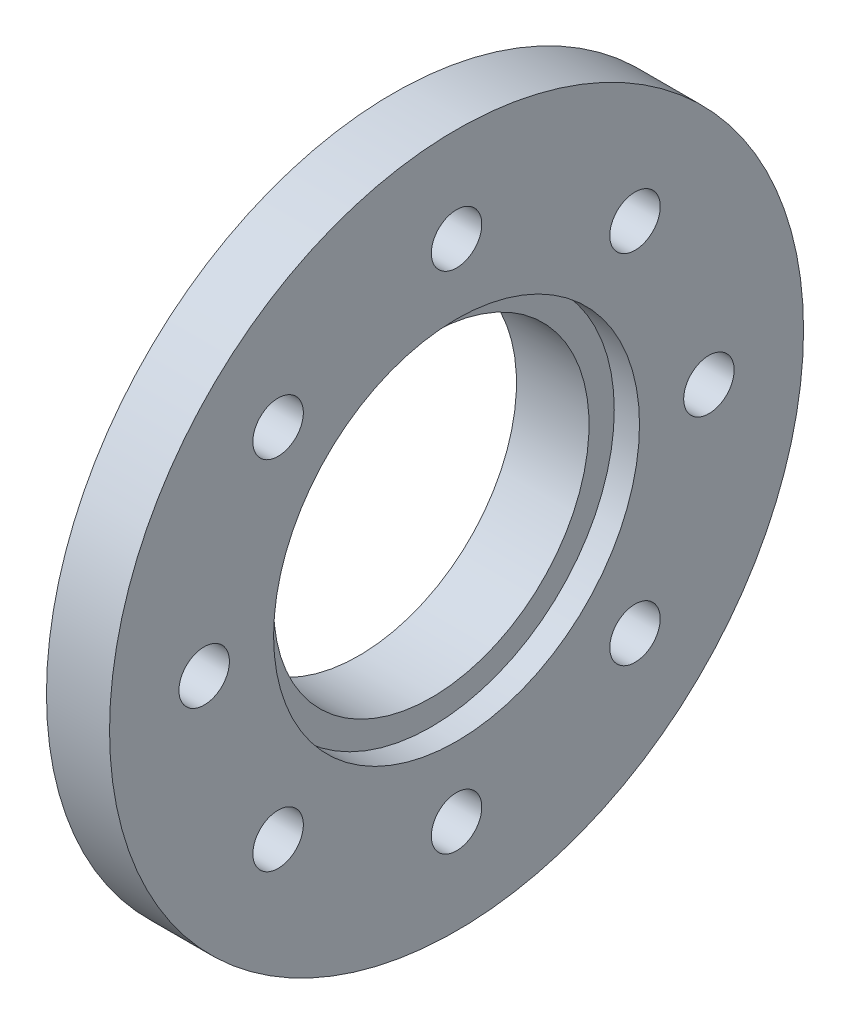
ISO-10303-21;
HEADER;
FILE_DESCRIPTION(('STEP AP214'),'2;1');
FILE_NAME('part.step','',(''),(''),'','','');
FILE_SCHEMA(('AUTOMOTIVE_DESIGN { 1 0 10303 214 1 1 1 1 }'));
ENDSEC;
DATA;
#1=APPLICATION_CONTEXT('core data for automotive mechanical design processes');
#2=APPLICATION_PROTOCOL_DEFINITION('international standard','automotive_design',2000,#1);
#3=PRODUCT_CONTEXT('',#1,'mechanical');
#4=PRODUCT('Part','Part','',(#3));
#5=PRODUCT_RELATED_PRODUCT_CATEGORY('part','',(#4));
#6=PRODUCT_DEFINITION_FORMATION('','',#4);
#7=PRODUCT_DEFINITION_CONTEXT('part definition',#1,'design');
#8=PRODUCT_DEFINITION('design','',#6,#7);
#9=PRODUCT_DEFINITION_SHAPE('','',#8);
#10=(LENGTH_UNIT() NAMED_UNIT(*) SI_UNIT(.MILLI.,.METRE.));
#11=(NAMED_UNIT(*) PLANE_ANGLE_UNIT() SI_UNIT($,.RADIAN.));
#12=(NAMED_UNIT(*) SI_UNIT($,.STERADIAN.) SOLID_ANGLE_UNIT());
#13=UNCERTAINTY_MEASURE_WITH_UNIT(LENGTH_MEASURE(1.E-05),#10,'distance_accuracy_value','');
#14=(GEOMETRIC_REPRESENTATION_CONTEXT(3) GLOBAL_UNCERTAINTY_ASSIGNED_CONTEXT((#13)) GLOBAL_UNIT_ASSIGNED_CONTEXT((#10,
#11,#12)) REPRESENTATION_CONTEXT('',''));
#15=CARTESIAN_POINT('',(0.,0.,0.));
#16=DIRECTION('',(0.,0.,1.));
#17=DIRECTION('',(1.,0.,0.));
#18=AXIS2_PLACEMENT_3D('',#15,#16,#17);
#19=CARTESIAN_POINT('',(0.,5.,0.));
#20=DIRECTION('',(1.,0.,0.));
#21=DIRECTION('',(0.,0.,-1.));
#22=AXIS2_PLACEMENT_3D('',#19,#20,#21);
#23=PLANE('',#22);
#24=CARTESIAN_POINT('',(0.,0.,0.));
#25=DIRECTION('',(-1.,0.,0.));
#26=DIRECTION('',(0.,0.,1.));
#27=AXIS2_PLACEMENT_3D('',#24,#25,#26);
#28=CIRCLE('',#27,6.25);
#29=CARTESIAN_POINT('',(0.,0.,6.25000000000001));
#30=VERTEX_POINT('',#29);
#31=EDGE_CURVE('E17',#30,#30,#28,.F.);
#32=ORIENTED_EDGE('',*,*,#31,.F.);
#33=EDGE_LOOP('',(#32));
#34=FACE_BOUND('',#33,.T.);
#35=CARTESIAN_POINT('',(0.,0.,0.));
#36=DIRECTION('',(-1.,0.,0.));
#37=DIRECTION('',(0.,0.,1.));
#38=AXIS2_PLACEMENT_3D('',#35,#36,#37);
#39=CIRCLE('',#38,5.);
#40=CARTESIAN_POINT('',(0.,0.,5.));
#41=VERTEX_POINT('',#40);
#42=EDGE_CURVE('E87',#41,#41,#39,.F.);
#43=ORIENTED_EDGE('',*,*,#42,.T.);
#44=EDGE_LOOP('',(#43));
#45=FACE_BOUND('',#44,.T.);
#46=ADVANCED_FACE('F13',(#34,#45),#23,.F.);
#47=CARTESIAN_POINT('',(0.,0.,0.));
#48=DIRECTION('',(-1.,0.,0.));
#49=DIRECTION('',(0.,0.,1.));
#50=AXIS2_PLACEMENT_3D('',#47,#48,#49);
#51=CYLINDRICAL_SURFACE('',#50,6.25);
#52=ORIENTED_EDGE('',*,*,#31,.T.);
#53=EDGE_LOOP('',(#52));
#54=FACE_BOUND('',#53,.T.);
#55=CARTESIAN_POINT('',(1.1,0.,0.));
#56=DIRECTION('',(-1.,0.,0.));
#57=DIRECTION('',(0.,0.,1.));
#58=AXIS2_PLACEMENT_3D('',#55,#56,#57);
#59=CIRCLE('',#58,6.25);
#60=CARTESIAN_POINT('',(1.1,0.,6.25000000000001));
#61=VERTEX_POINT('',#60);
#62=EDGE_CURVE('E85',#61,#61,#59,.T.);
#63=ORIENTED_EDGE('',*,*,#62,.T.);
#64=EDGE_LOOP('',(#63));
#65=FACE_BOUND('',#64,.T.);
#66=ADVANCED_FACE('F94',(#54,#65),#51,.T.);
#67=CARTESIAN_POINT('',(0.,0.,0.));
#68=DIRECTION('',(-1.,0.,0.));
#69=DIRECTION('',(0.,0.,1.));
#70=AXIS2_PLACEMENT_3D('',#67,#68,#69);
#71=CYLINDRICAL_SURFACE('',#70,5.);
#72=CARTESIAN_POINT('',(2.3,0.,0.));
#73=DIRECTION('',(-1.,0.,0.));
#74=DIRECTION('',(0.,0.,1.));
#75=AXIS2_PLACEMENT_3D('',#72,#73,#74);
#76=CIRCLE('',#75,5.);
#77=CARTESIAN_POINT('',(2.3,0.,5.));
#78=VERTEX_POINT('',#77);
#79=EDGE_CURVE('E82',#78,#78,#76,.F.);
#80=ORIENTED_EDGE('',*,*,#79,.T.);
#81=EDGE_LOOP('',(#80));
#82=FACE_BOUND('',#81,.T.);
#83=ORIENTED_EDGE('',*,*,#42,.F.);
#84=EDGE_LOOP('',(#83));
#85=FACE_BOUND('',#84,.T.);
#86=ADVANCED_FACE('F102',(#82,#85),#71,.F.);
#87=CARTESIAN_POINT('',(1.1,6.25,0.));
#88=DIRECTION('',(1.,0.,0.));
#89=DIRECTION('',(0.,0.,-1.));
#90=AXIS2_PLACEMENT_3D('',#87,#88,#89);
#91=PLANE('',#90);
#92=CARTESIAN_POINT('',(1.1,5.65685424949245,-5.65685424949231));
#93=DIRECTION('',(-1.,0.,0.));
#94=DIRECTION('',(0.,0.,1.));
#95=AXIS2_PLACEMENT_3D('',#92,#93,#94);
#96=CIRCLE('',#95,0.799999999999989);
#97=CARTESIAN_POINT('',(1.1,5.65685424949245,-4.85685424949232));
#98=VERTEX_POINT('',#97);
#99=EDGE_CURVE('E79',#98,#98,#96,.F.);
#100=ORIENTED_EDGE('',*,*,#99,.T.);
#101=EDGE_LOOP('',(#100));
#102=FACE_BOUND('',#101,.T.);
#103=CARTESIAN_POINT('',(1.1,0.,-8.00000000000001));
#104=DIRECTION('',(-1.,0.,0.));
#105=DIRECTION('',(0.,0.,1.));
#106=AXIS2_PLACEMENT_3D('',#103,#104,#105);
#107=CIRCLE('',#106,0.799999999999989);
#108=CARTESIAN_POINT('',(1.1,0.,-7.20000000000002));
#109=VERTEX_POINT('',#108);
#110=EDGE_CURVE('E76',#109,#109,#107,.F.);
#111=ORIENTED_EDGE('',*,*,#110,.T.);
#112=EDGE_LOOP('',(#111));
#113=FACE_BOUND('',#112,.T.);
#114=CARTESIAN_POINT('',(1.1,0.,0.));
#115=DIRECTION('',(-1.,0.,0.));
#116=DIRECTION('',(0.,0.,1.));
#117=AXIS2_PLACEMENT_3D('',#114,#115,#116);
#118=CIRCLE('',#117,11.);
#119=CARTESIAN_POINT('',(1.1,0.,11.));
#120=VERTEX_POINT('',#119);
#121=EDGE_CURVE('E55',#120,#120,#118,.F.);
#122=ORIENTED_EDGE('',*,*,#121,.F.);
#123=EDGE_LOOP('',(#122));
#124=FACE_BOUND('',#123,.T.);
#125=ORIENTED_EDGE('',*,*,#62,.F.);
#126=EDGE_LOOP('',(#125));
#127=FACE_BOUND('',#126,.T.);
#128=CARTESIAN_POINT('',(1.1,8.,0.));
#129=DIRECTION('',(-1.,0.,0.));
#130=DIRECTION('',(0.,0.,1.));
#131=AXIS2_PLACEMENT_3D('',#128,#129,#130);
#132=CIRCLE('',#131,0.799999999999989);
#133=CARTESIAN_POINT('',(1.1,8.,0.799999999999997));
#134=VERTEX_POINT('',#133);
#135=EDGE_CURVE('E58',#134,#134,#132,.F.);
#136=ORIENTED_EDGE('',*,*,#135,.T.);
#137=EDGE_LOOP('',(#136));
#138=FACE_BOUND('',#137,.T.);
#139=CARTESIAN_POINT('',(1.1,5.65685424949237,5.6568542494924));
#140=DIRECTION('',(-1.,0.,0.));
#141=DIRECTION('',(0.,0.,1.));
#142=AXIS2_PLACEMENT_3D('',#139,#140,#141);
#143=CIRCLE('',#142,0.799999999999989);
#144=CARTESIAN_POINT('',(1.1,5.65685424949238,6.45685424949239));
#145=VERTEX_POINT('',#144);
#146=EDGE_CURVE('E61',#145,#145,#143,.F.);
#147=ORIENTED_EDGE('',*,*,#146,.T.);
#148=EDGE_LOOP('',(#147));
#149=FACE_BOUND('',#148,.T.);
#150=CARTESIAN_POINT('',(1.1,0.,8.00000000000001));
#151=DIRECTION('',(-1.,0.,0.));
#152=DIRECTION('',(0.,0.,1.));
#153=AXIS2_PLACEMENT_3D('',#150,#151,#152);
#154=CIRCLE('',#153,0.799999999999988);
#155=CARTESIAN_POINT('',(1.1,0.,8.8));
#156=VERTEX_POINT('',#155);
#157=EDGE_CURVE('E64',#156,#156,#154,.F.);
#158=ORIENTED_EDGE('',*,*,#157,.T.);
#159=EDGE_LOOP('',(#158));
#160=FACE_BOUND('',#159,.T.);
#161=CARTESIAN_POINT('',(1.1,-5.65685424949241,5.65685424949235));
#162=DIRECTION('',(-1.,0.,0.));
#163=DIRECTION('',(0.,0.,1.));
#164=AXIS2_PLACEMENT_3D('',#161,#162,#163);
#165=CIRCLE('',#164,0.799999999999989);
#166=CARTESIAN_POINT('',(1.1,-5.65685424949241,6.45685424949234));
#167=VERTEX_POINT('',#166);
#168=EDGE_CURVE('E67',#167,#167,#165,.F.);
#169=ORIENTED_EDGE('',*,*,#168,.T.);
#170=EDGE_LOOP('',(#169));
#171=FACE_BOUND('',#170,.T.);
#172=CARTESIAN_POINT('',(1.1,-8.,0.));
#173=DIRECTION('',(-1.,0.,0.));
#174=DIRECTION('',(0.,0.,1.));
#175=AXIS2_PLACEMENT_3D('',#172,#173,#174);
#176=CIRCLE('',#175,0.799999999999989);
#177=CARTESIAN_POINT('',(1.1,-8.,0.799999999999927));
#178=VERTEX_POINT('',#177);
#179=EDGE_CURVE('E70',#178,#178,#176,.F.);
#180=ORIENTED_EDGE('',*,*,#179,.T.);
#181=EDGE_LOOP('',(#180));
#182=FACE_BOUND('',#181,.T.);
#183=CARTESIAN_POINT('',(1.1,-5.65685424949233,-5.65685424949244));
#184=DIRECTION('',(-1.,0.,0.));
#185=DIRECTION('',(0.,0.,1.));
#186=AXIS2_PLACEMENT_3D('',#183,#184,#185);
#187=CIRCLE('',#186,0.799999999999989);
#188=CARTESIAN_POINT('',(1.1,-5.65685424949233,-4.85685424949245));
#189=VERTEX_POINT('',#188);
#190=EDGE_CURVE('E73',#189,#189,#187,.F.);
#191=ORIENTED_EDGE('',*,*,#190,.T.);
#192=EDGE_LOOP('',(#191));
#193=FACE_BOUND('',#192,.T.);
#194=ADVANCED_FACE('F137',(#102,#113,#124,#127,#138,#149,#160,#171,#182,#193),#91,.F.);
#195=CARTESIAN_POINT('',(2.3,5.8,0.));
#196=DIRECTION('',(-1.,0.,0.));
#197=DIRECTION('',(0.,0.,1.));
#198=AXIS2_PLACEMENT_3D('',#195,#196,#197);
#199=PLANE('',#198);
#200=ORIENTED_EDGE('',*,*,#79,.F.);
#201=EDGE_LOOP('',(#200));
#202=FACE_BOUND('',#201,.T.);
#203=CARTESIAN_POINT('',(2.3,0.,0.));
#204=DIRECTION('',(-1.,0.,0.));
#205=DIRECTION('',(0.,0.,1.));
#206=AXIS2_PLACEMENT_3D('',#203,#204,#205);
#207=CIRCLE('',#206,5.8);
#208=CARTESIAN_POINT('',(2.3,0.,5.80000000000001));
#209=VERTEX_POINT('',#208);
#210=EDGE_CURVE('E52',#209,#209,#207,.F.);
#211=ORIENTED_EDGE('',*,*,#210,.T.);
#212=EDGE_LOOP('',(#211));
#213=FACE_BOUND('',#212,.T.);
#214=ADVANCED_FACE('F133',(#202,#213),#199,.F.);
#215=CARTESIAN_POINT('',(1.1,5.65685424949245,-5.65685424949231));
#216=DIRECTION('',(-1.,0.,0.));
#217=DIRECTION('',(0.,0.,1.));
#218=AXIS2_PLACEMENT_3D('',#215,#216,#217);
#219=CYLINDRICAL_SURFACE('',#218,0.799999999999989);
#220=CARTESIAN_POINT('',(3.1,5.65685424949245,-5.65685424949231));
#221=DIRECTION('',(-1.,0.,0.));
#222=DIRECTION('',(0.,0.,1.));
#223=AXIS2_PLACEMENT_3D('',#220,#221,#222);
#224=CIRCLE('',#223,0.799999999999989);
#225=CARTESIAN_POINT('',(3.1,5.65685424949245,-4.85685424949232));
#226=VERTEX_POINT('',#225);
#227=EDGE_CURVE('E49',#226,#226,#224,.F.);
#228=ORIENTED_EDGE('',*,*,#227,.T.);
#229=EDGE_LOOP('',(#228));
#230=FACE_BOUND('',#229,.T.);
#231=ORIENTED_EDGE('',*,*,#99,.F.);
#232=EDGE_LOOP('',(#231));
#233=FACE_BOUND('',#232,.T.);
#234=ADVANCED_FACE('F129',(#230,#233),#219,.F.);
#235=CARTESIAN_POINT('',(1.1,0.,-8.00000000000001));
#236=DIRECTION('',(-1.,0.,0.));
#237=DIRECTION('',(0.,0.,1.));
#238=AXIS2_PLACEMENT_3D('',#235,#236,#237);
#239=CYLINDRICAL_SURFACE('',#238,0.799999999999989);
#240=CARTESIAN_POINT('',(3.1,0.,-8.00000000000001));
#241=DIRECTION('',(-1.,0.,0.));
#242=DIRECTION('',(0.,0.,1.));
#243=AXIS2_PLACEMENT_3D('',#240,#241,#242);
#244=CIRCLE('',#243,0.799999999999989);
#245=CARTESIAN_POINT('',(3.1,0.,-7.20000000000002));
#246=VERTEX_POINT('',#245);
#247=EDGE_CURVE('E46',#246,#246,#244,.F.);
#248=ORIENTED_EDGE('',*,*,#247,.T.);
#249=EDGE_LOOP('',(#248));
#250=FACE_BOUND('',#249,.T.);
#251=ORIENTED_EDGE('',*,*,#110,.F.);
#252=EDGE_LOOP('',(#251));
#253=FACE_BOUND('',#252,.T.);
#254=ADVANCED_FACE('F132',(#250,#253),#239,.F.);
#255=CARTESIAN_POINT('',(1.1,-5.65685424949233,-5.65685424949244));
#256=DIRECTION('',(-1.,0.,0.));
#257=DIRECTION('',(0.,0.,1.));
#258=AXIS2_PLACEMENT_3D('',#255,#256,#257);
#259=CYLINDRICAL_SURFACE('',#258,0.799999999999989);
#260=CARTESIAN_POINT('',(3.1,-5.65685424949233,-5.65685424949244));
#261=DIRECTION('',(-1.,0.,0.));
#262=DIRECTION('',(0.,0.,1.));
#263=AXIS2_PLACEMENT_3D('',#260,#261,#262);
#264=CIRCLE('',#263,0.799999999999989);
#265=CARTESIAN_POINT('',(3.1,-5.65685424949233,-4.85685424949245));
#266=VERTEX_POINT('',#265);
#267=EDGE_CURVE('E43',#266,#266,#264,.F.);
#268=ORIENTED_EDGE('',*,*,#267,.T.);
#269=EDGE_LOOP('',(#268));
#270=FACE_BOUND('',#269,.T.);
#271=ORIENTED_EDGE('',*,*,#190,.F.);
#272=EDGE_LOOP('',(#271));
#273=FACE_BOUND('',#272,.T.);
#274=ADVANCED_FACE('F159',(#270,#273),#259,.F.);
#275=CARTESIAN_POINT('',(1.1,-8.,0.));
#276=DIRECTION('',(-1.,0.,0.));
#277=DIRECTION('',(0.,0.,1.));
#278=AXIS2_PLACEMENT_3D('',#275,#276,#277);
#279=CYLINDRICAL_SURFACE('',#278,0.799999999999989);
#280=CARTESIAN_POINT('',(3.1,-8.,0.));
#281=DIRECTION('',(-1.,0.,0.));
#282=DIRECTION('',(0.,0.,1.));
#283=AXIS2_PLACEMENT_3D('',#280,#281,#282);
#284=CIRCLE('',#283,0.799999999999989);
#285=CARTESIAN_POINT('',(3.1,-8.,0.799999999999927));
#286=VERTEX_POINT('',#285);
#287=EDGE_CURVE('E40',#286,#286,#284,.F.);
#288=ORIENTED_EDGE('',*,*,#287,.T.);
#289=EDGE_LOOP('',(#288));
#290=FACE_BOUND('',#289,.T.);
#291=ORIENTED_EDGE('',*,*,#179,.F.);
#292=EDGE_LOOP('',(#291));
#293=FACE_BOUND('',#292,.T.);
#294=ADVANCED_FACE('F161',(#290,#293),#279,.F.);
#295=CARTESIAN_POINT('',(1.1,-5.65685424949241,5.65685424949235));
#296=DIRECTION('',(-1.,0.,0.));
#297=DIRECTION('',(0.,0.,1.));
#298=AXIS2_PLACEMENT_3D('',#295,#296,#297);
#299=CYLINDRICAL_SURFACE('',#298,0.799999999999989);
#300=CARTESIAN_POINT('',(3.1,-5.65685424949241,5.65685424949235));
#301=DIRECTION('',(-1.,0.,0.));
#302=DIRECTION('',(0.,0.,1.));
#303=AXIS2_PLACEMENT_3D('',#300,#301,#302);
#304=CIRCLE('',#303,0.799999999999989);
#305=CARTESIAN_POINT('',(3.1,-5.65685424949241,6.45685424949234));
#306=VERTEX_POINT('',#305);
#307=EDGE_CURVE('E37',#306,#306,#304,.F.);
#308=ORIENTED_EDGE('',*,*,#307,.T.);
#309=EDGE_LOOP('',(#308));
#310=FACE_BOUND('',#309,.T.);
#311=ORIENTED_EDGE('',*,*,#168,.F.);
#312=EDGE_LOOP('',(#311));
#313=FACE_BOUND('',#312,.T.);
#314=ADVANCED_FACE('F166',(#310,#313),#299,.F.);
#315=CARTESIAN_POINT('',(1.1,0.,8.00000000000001));
#316=DIRECTION('',(-1.,0.,0.));
#317=DIRECTION('',(0.,0.,1.));
#318=AXIS2_PLACEMENT_3D('',#315,#316,#317);
#319=CYLINDRICAL_SURFACE('',#318,0.799999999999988);
#320=CARTESIAN_POINT('',(3.1,0.,8.00000000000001));
#321=DIRECTION('',(-1.,0.,0.));
#322=DIRECTION('',(0.,0.,1.));
#323=AXIS2_PLACEMENT_3D('',#320,#321,#322);
#324=CIRCLE('',#323,0.799999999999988);
#325=CARTESIAN_POINT('',(3.1,0.,8.8));
#326=VERTEX_POINT('',#325);
#327=EDGE_CURVE('E34',#326,#326,#324,.F.);
#328=ORIENTED_EDGE('',*,*,#327,.T.);
#329=EDGE_LOOP('',(#328));
#330=FACE_BOUND('',#329,.T.);
#331=ORIENTED_EDGE('',*,*,#157,.F.);
#332=EDGE_LOOP('',(#331));
#333=FACE_BOUND('',#332,.T.);
#334=ADVANCED_FACE('F175',(#330,#333),#319,.F.);
#335=CARTESIAN_POINT('',(1.1,5.65685424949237,5.6568542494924));
#336=DIRECTION('',(-1.,0.,0.));
#337=DIRECTION('',(0.,0.,1.));
#338=AXIS2_PLACEMENT_3D('',#335,#336,#337);
#339=CYLINDRICAL_SURFACE('',#338,0.799999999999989);
#340=CARTESIAN_POINT('',(3.1,5.65685424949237,5.6568542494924));
#341=DIRECTION('',(-1.,0.,0.));
#342=DIRECTION('',(0.,0.,1.));
#343=AXIS2_PLACEMENT_3D('',#340,#341,#342);
#344=CIRCLE('',#343,0.799999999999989);
#345=CARTESIAN_POINT('',(3.1,5.65685424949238,6.45685424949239));
#346=VERTEX_POINT('',#345);
#347=EDGE_CURVE('E31',#346,#346,#344,.F.);
#348=ORIENTED_EDGE('',*,*,#347,.T.);
#349=EDGE_LOOP('',(#348));
#350=FACE_BOUND('',#349,.T.);
#351=ORIENTED_EDGE('',*,*,#146,.F.);
#352=EDGE_LOOP('',(#351));
#353=FACE_BOUND('',#352,.T.);
#354=ADVANCED_FACE('F179',(#350,#353),#339,.F.);
#355=CARTESIAN_POINT('',(1.1,8.,0.));
#356=DIRECTION('',(-1.,0.,0.));
#357=DIRECTION('',(0.,0.,1.));
#358=AXIS2_PLACEMENT_3D('',#355,#356,#357);
#359=CYLINDRICAL_SURFACE('',#358,0.799999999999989);
#360=CARTESIAN_POINT('',(3.1,8.,0.));
#361=DIRECTION('',(-1.,0.,0.));
#362=DIRECTION('',(0.,0.,1.));
#363=AXIS2_PLACEMENT_3D('',#360,#361,#362);
#364=CIRCLE('',#363,0.799999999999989);
#365=CARTESIAN_POINT('',(3.1,8.,0.799999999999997));
#366=VERTEX_POINT('',#365);
#367=EDGE_CURVE('E26',#366,#366,#364,.F.);
#368=ORIENTED_EDGE('',*,*,#367,.T.);
#369=EDGE_LOOP('',(#368));
#370=FACE_BOUND('',#369,.T.);
#371=ORIENTED_EDGE('',*,*,#135,.F.);
#372=EDGE_LOOP('',(#371));
#373=FACE_BOUND('',#372,.T.);
#374=ADVANCED_FACE('F183',(#370,#373),#359,.F.);
#375=CARTESIAN_POINT('',(0.,0.,0.));
#376=DIRECTION('',(-1.,0.,0.));
#377=DIRECTION('',(0.,0.,1.));
#378=AXIS2_PLACEMENT_3D('',#375,#376,#377);
#379=CYLINDRICAL_SURFACE('',#378,11.);
#380=ORIENTED_EDGE('',*,*,#121,.T.);
#381=EDGE_LOOP('',(#380));
#382=FACE_BOUND('',#381,.T.);
#383=CARTESIAN_POINT('',(3.1,0.,0.));
#384=DIRECTION('',(-1.,0.,0.));
#385=DIRECTION('',(0.,0.,1.));
#386=AXIS2_PLACEMENT_3D('',#383,#384,#385);
#387=CIRCLE('',#386,11.);
#388=CARTESIAN_POINT('',(3.1,0.,11.));
#389=VERTEX_POINT('',#388);
#390=EDGE_CURVE('E21',#389,#389,#387,.T.);
#391=ORIENTED_EDGE('',*,*,#390,.T.);
#392=EDGE_LOOP('',(#391));
#393=FACE_BOUND('',#392,.T.);
#394=ADVANCED_FACE('F109',(#382,#393),#379,.T.);
#395=CARTESIAN_POINT('',(0.,0.,0.));
#396=DIRECTION('',(-1.,0.,0.));
#397=DIRECTION('',(0.,0.,1.));
#398=AXIS2_PLACEMENT_3D('',#395,#396,#397);
#399=CYLINDRICAL_SURFACE('',#398,5.8);
#400=CARTESIAN_POINT('',(3.1,0.,0.));
#401=DIRECTION('',(-1.,0.,0.));
#402=DIRECTION('',(0.,0.,1.));
#403=AXIS2_PLACEMENT_3D('',#400,#401,#402);
#404=CIRCLE('',#403,5.8);
#405=CARTESIAN_POINT('',(3.1,0.,5.80000000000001));
#406=VERTEX_POINT('',#405);
#407=EDGE_CURVE('E9',#406,#406,#404,.F.);
#408=ORIENTED_EDGE('',*,*,#407,.T.);
#409=EDGE_LOOP('',(#408));
#410=FACE_BOUND('',#409,.T.);
#411=ORIENTED_EDGE('',*,*,#210,.F.);
#412=EDGE_LOOP('',(#411));
#413=FACE_BOUND('',#412,.T.);
#414=ADVANCED_FACE('F105',(#410,#413),#399,.F.);
#415=CARTESIAN_POINT('',(3.1,11.,0.));
#416=DIRECTION('',(-1.,0.,0.));
#417=DIRECTION('',(0.,0.,1.));
#418=AXIS2_PLACEMENT_3D('',#415,#416,#417);
#419=PLANE('',#418);
#420=ORIENTED_EDGE('',*,*,#407,.F.);
#421=EDGE_LOOP('',(#420));
#422=FACE_BOUND('',#421,.T.);
#423=ORIENTED_EDGE('',*,*,#390,.F.);
#424=EDGE_LOOP('',(#423));
#425=FACE_BOUND('',#424,.T.);
#426=ORIENTED_EDGE('',*,*,#367,.F.);
#427=EDGE_LOOP('',(#426));
#428=FACE_BOUND('',#427,.T.);
#429=ORIENTED_EDGE('',*,*,#347,.F.);
#430=EDGE_LOOP('',(#429));
#431=FACE_BOUND('',#430,.T.);
#432=ORIENTED_EDGE('',*,*,#327,.F.);
#433=EDGE_LOOP('',(#432));
#434=FACE_BOUND('',#433,.T.);
#435=ORIENTED_EDGE('',*,*,#307,.F.);
#436=EDGE_LOOP('',(#435));
#437=FACE_BOUND('',#436,.T.);
#438=ORIENTED_EDGE('',*,*,#287,.F.);
#439=EDGE_LOOP('',(#438));
#440=FACE_BOUND('',#439,.T.);
#441=ORIENTED_EDGE('',*,*,#267,.F.);
#442=EDGE_LOOP('',(#441));
#443=FACE_BOUND('',#442,.T.);
#444=ORIENTED_EDGE('',*,*,#247,.F.);
#445=EDGE_LOOP('',(#444));
#446=FACE_BOUND('',#445,.T.);
#447=ORIENTED_EDGE('',*,*,#227,.F.);
#448=EDGE_LOOP('',(#447));
#449=FACE_BOUND('',#448,.T.);
#450=ADVANCED_FACE('F15',(#422,#425,#428,#431,#434,#437,#440,#443,#446,#449),#419,.F.);
#451=CLOSED_SHELL('',(#46,#66,#86,#194,#214,#234,#254,#274,#294,#314,#334,#354,#374,#394,#414,#450));
#452=MANIFOLD_SOLID_BREP('B1',#451);
#453=ADVANCED_BREP_SHAPE_REPRESENTATION('',(#18,#452),#14);
#454=SHAPE_DEFINITION_REPRESENTATION(#9,#453);
ENDSEC;
END-ISO-10303-21;
